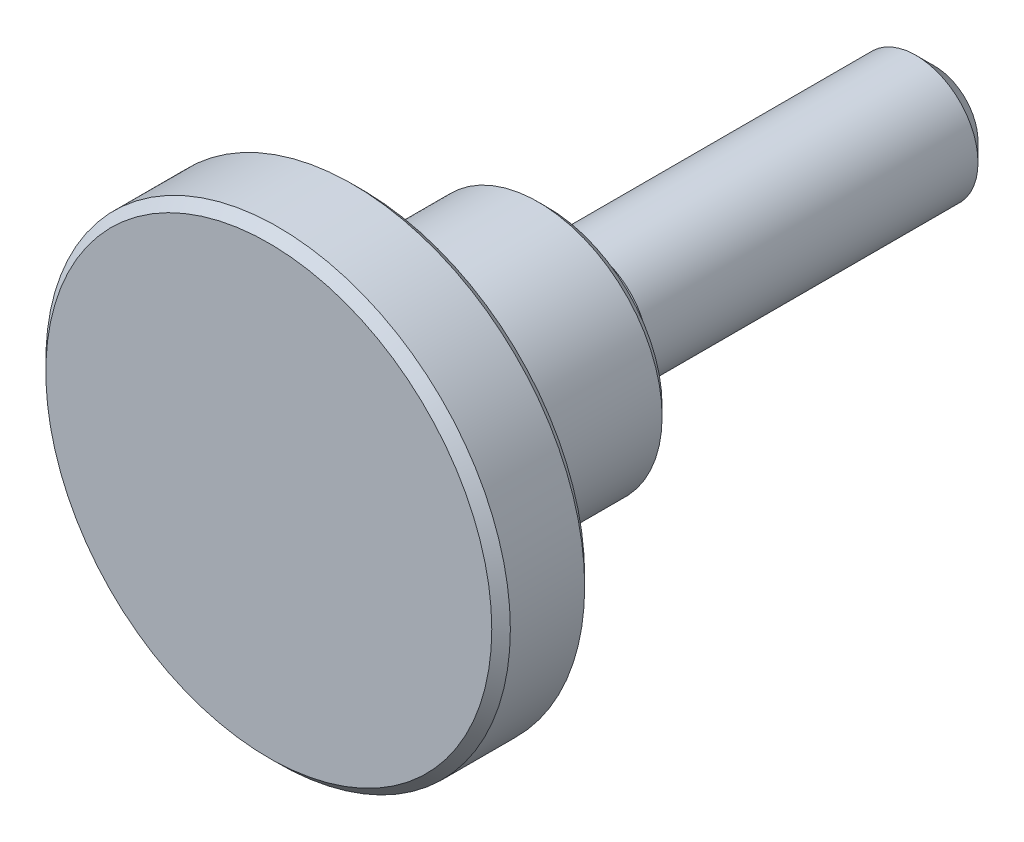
ISO-10303-21;
HEADER;
FILE_DESCRIPTION(('STEP AP214'),'2;1');
FILE_NAME('part.step','',(''),(''),'','','');
FILE_SCHEMA(('AUTOMOTIVE_DESIGN { 1 0 10303 214 1 1 1 1 }'));
ENDSEC;
DATA;
#1=APPLICATION_CONTEXT('core data for automotive mechanical design processes');
#2=APPLICATION_PROTOCOL_DEFINITION('international standard','automotive_design',2000,#1);
#3=PRODUCT_CONTEXT('',#1,'mechanical');
#4=PRODUCT('Part','Part','',(#3));
#5=PRODUCT_RELATED_PRODUCT_CATEGORY('part','',(#4));
#6=PRODUCT_DEFINITION_FORMATION('','',#4);
#7=PRODUCT_DEFINITION_CONTEXT('part definition',#1,'design');
#8=PRODUCT_DEFINITION('design','',#6,#7);
#9=PRODUCT_DEFINITION_SHAPE('','',#8);
#10=(LENGTH_UNIT() NAMED_UNIT(*) SI_UNIT(.MILLI.,.METRE.));
#11=(NAMED_UNIT(*) PLANE_ANGLE_UNIT() SI_UNIT($,.RADIAN.));
#12=(NAMED_UNIT(*) SI_UNIT($,.STERADIAN.) SOLID_ANGLE_UNIT());
#13=UNCERTAINTY_MEASURE_WITH_UNIT(LENGTH_MEASURE(1.E-05),#10,'distance_accuracy_value','');
#14=(GEOMETRIC_REPRESENTATION_CONTEXT(3) GLOBAL_UNCERTAINTY_ASSIGNED_CONTEXT((#13)) GLOBAL_UNIT_ASSIGNED_CONTEXT((#10,
#11,#12)) REPRESENTATION_CONTEXT('',''));
#15=CARTESIAN_POINT('',(0.,0.,0.));
#16=DIRECTION('',(0.,0.,1.));
#17=DIRECTION('',(1.,0.,0.));
#18=AXIS2_PLACEMENT_3D('',#15,#16,#17);
#19=CARTESIAN_POINT('',(0.,2.8,-25.));
#20=DIRECTION('',(0.,0.,1.));
#21=DIRECTION('',(1.,0.,0.));
#22=AXIS2_PLACEMENT_3D('',#19,#20,#21);
#23=PLANE('',#22);
#24=CARTESIAN_POINT('',(0.,0.,-25.));
#25=DIRECTION('',(0.,0.,1.));
#26=DIRECTION('',(1.,0.,0.));
#27=AXIS2_PLACEMENT_3D('',#24,#25,#26);
#28=CIRCLE('',#27,2.8);
#29=CARTESIAN_POINT('',(2.8,0.,-25.));
#30=VERTEX_POINT('',#29);
#31=EDGE_CURVE('E8',#30,#30,#28,.T.);
#32=ORIENTED_EDGE('',*,*,#31,.F.);
#33=EDGE_LOOP('',(#32));
#34=FACE_BOUND('',#33,.T.);
#35=ADVANCED_FACE('F12',(#34),#23,.F.);
#36=CARTESIAN_POINT('',(0.,0.,-25.));
#37=DIRECTION('',(0.,0.,1.));
#38=DIRECTION('',(1.,0.,0.));
#39=AXIS2_PLACEMENT_3D('',#36,#37,#38);
#40=CONICAL_SURFACE('',#39,2.8,0.78539816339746);
#41=CARTESIAN_POINT('',(0.,0.,-23.8));
#42=DIRECTION('',(0.,0.,1.));
#43=DIRECTION('',(1.,0.,0.));
#44=AXIS2_PLACEMENT_3D('',#41,#42,#43);
#45=CIRCLE('',#44,4.);
#46=CARTESIAN_POINT('',(4.,0.,-23.8));
#47=VERTEX_POINT('',#46);
#48=EDGE_CURVE('E18',#47,#47,#45,.T.);
#49=ORIENTED_EDGE('',*,*,#48,.F.);
#50=EDGE_LOOP('',(#49));
#51=FACE_BOUND('',#50,.T.);
#52=ORIENTED_EDGE('',*,*,#31,.T.);
#53=EDGE_LOOP('',(#52));
#54=FACE_BOUND('',#53,.T.);
#55=ADVANCED_FACE('F141',(#51,#54),#40,.T.);
#56=CARTESIAN_POINT('',(0.,0.,23.));
#57=DIRECTION('',(0.,0.,1.));
#58=DIRECTION('',(1.,0.,0.));
#59=AXIS2_PLACEMENT_3D('',#56,#57,#58);
#60=CYLINDRICAL_SURFACE('',#59,4.);
#61=CARTESIAN_POINT('',(0.,0.,-2.5));
#62=DIRECTION('',(0.,0.,1.));
#63=DIRECTION('',(1.,0.,0.));
#64=AXIS2_PLACEMENT_3D('',#61,#62,#63);
#65=CIRCLE('',#64,4.);
#66=CARTESIAN_POINT('',(4.,0.,-2.5));
#67=VERTEX_POINT('',#66);
#68=EDGE_CURVE('E22',#67,#67,#65,.T.);
#69=ORIENTED_EDGE('',*,*,#68,.F.);
#70=EDGE_LOOP('',(#69));
#71=FACE_BOUND('',#70,.T.);
#72=ORIENTED_EDGE('',*,*,#48,.T.);
#73=EDGE_LOOP('',(#72));
#74=FACE_BOUND('',#73,.T.);
#75=ADVANCED_FACE('F136',(#71,#74),#60,.T.);
#76=CARTESIAN_POINT('',(0.,4.,-2.5));
#77=DIRECTION('',(0.,0.,-1.));
#78=DIRECTION('',(-1.,0.,0.));
#79=AXIS2_PLACEMENT_3D('',#76,#77,#78);
#80=PLANE('',#79);
#81=CARTESIAN_POINT('',(0.,0.,-2.5));
#82=DIRECTION('',(0.,0.,1.));
#83=DIRECTION('',(1.,0.,0.));
#84=AXIS2_PLACEMENT_3D('',#81,#82,#83);
#85=CIRCLE('',#84,3.6);
#86=CARTESIAN_POINT('',(3.6,0.,-2.5));
#87=VERTEX_POINT('',#86);
#88=EDGE_CURVE('E26',#87,#87,#85,.T.);
#89=ORIENTED_EDGE('',*,*,#88,.F.);
#90=EDGE_LOOP('',(#89));
#91=FACE_BOUND('',#90,.T.);
#92=ORIENTED_EDGE('',*,*,#68,.T.);
#93=EDGE_LOOP('',(#92));
#94=FACE_BOUND('',#93,.T.);
#95=ADVANCED_FACE('F130',(#91,#94),#80,.F.);
#96=CARTESIAN_POINT('',(0.,0.,-1.9));
#97=DIRECTION('',(0.,0.,1.));
#98=DIRECTION('',(1.,0.,0.));
#99=AXIS2_PLACEMENT_3D('',#96,#97,#98);
#100=TOROIDAL_SURFACE('',#99,3.6,0.6);
#101=CARTESIAN_POINT('',(0.,0.,-1.9));
#102=DIRECTION('',(0.,0.,1.));
#103=DIRECTION('',(1.,0.,0.));
#104=AXIS2_PLACEMENT_3D('',#101,#102,#103);
#105=CIRCLE('',#104,3.);
#106=CARTESIAN_POINT('',(3.,0.,-1.9));
#107=VERTEX_POINT('',#106);
#108=EDGE_CURVE('E31',#107,#107,#105,.T.);
#109=ORIENTED_EDGE('',*,*,#108,.F.);
#110=EDGE_LOOP('',(#109));
#111=FACE_BOUND('',#110,.T.);
#112=ORIENTED_EDGE('',*,*,#88,.T.);
#113=EDGE_LOOP('',(#112));
#114=FACE_BOUND('',#113,.T.);
#115=ADVANCED_FACE('F124',(#111,#114),#100,.F.);
#116=CARTESIAN_POINT('',(0.,0.,23.));
#117=DIRECTION('',(0.,0.,1.));
#118=DIRECTION('',(1.,0.,0.));
#119=AXIS2_PLACEMENT_3D('',#116,#117,#118);
#120=CYLINDRICAL_SURFACE('',#119,3.);
#121=CARTESIAN_POINT('',(0.,0.,-0.599999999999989));
#122=DIRECTION('',(0.,0.,1.));
#123=DIRECTION('',(1.,0.,0.));
#124=AXIS2_PLACEMENT_3D('',#121,#122,#123);
#125=CIRCLE('',#124,3.);
#126=CARTESIAN_POINT('',(3.,0.,-0.599999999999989));
#127=VERTEX_POINT('',#126);
#128=EDGE_CURVE('E34',#127,#127,#125,.T.);
#129=ORIENTED_EDGE('',*,*,#128,.F.);
#130=EDGE_LOOP('',(#129));
#131=FACE_BOUND('',#130,.T.);
#132=ORIENTED_EDGE('',*,*,#108,.T.);
#133=EDGE_LOOP('',(#132));
#134=FACE_BOUND('',#133,.T.);
#135=ADVANCED_FACE('F118',(#131,#134),#120,.T.);
#136=CARTESIAN_POINT('',(0.,0.,-0.599999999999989));
#137=DIRECTION('',(0.,0.,1.));
#138=DIRECTION('',(1.,0.,0.));
#139=AXIS2_PLACEMENT_3D('',#136,#137,#138);
#140=TOROIDAL_SURFACE('',#139,3.6,0.6);
#141=CARTESIAN_POINT('',(0.,0.,0.));
#142=DIRECTION('',(0.,0.,1.));
#143=DIRECTION('',(1.,0.,0.));
#144=AXIS2_PLACEMENT_3D('',#141,#142,#143);
#145=CIRCLE('',#144,3.6);
#146=CARTESIAN_POINT('',(3.6,0.,0.));
#147=VERTEX_POINT('',#146);
#148=EDGE_CURVE('E37',#147,#147,#145,.T.);
#149=ORIENTED_EDGE('',*,*,#148,.F.);
#150=EDGE_LOOP('',(#149));
#151=FACE_BOUND('',#150,.T.);
#152=ORIENTED_EDGE('',*,*,#128,.T.);
#153=EDGE_LOOP('',(#152));
#154=FACE_BOUND('',#153,.T.);
#155=ADVANCED_FACE('F112',(#151,#154),#140,.F.);
#156=CARTESIAN_POINT('',(0.,7.4,0.));
#157=DIRECTION('',(0.,0.,1.));
#158=DIRECTION('',(1.,0.,0.));
#159=AXIS2_PLACEMENT_3D('',#156,#157,#158);
#160=PLANE('',#159);
#161=CARTESIAN_POINT('',(0.,0.,0.));
#162=DIRECTION('',(0.,0.,1.));
#163=DIRECTION('',(1.,0.,0.));
#164=AXIS2_PLACEMENT_3D('',#161,#162,#163);
#165=CIRCLE('',#164,7.4);
#166=CARTESIAN_POINT('',(7.4,0.,0.));
#167=VERTEX_POINT('',#166);
#168=EDGE_CURVE('E40',#167,#167,#165,.T.);
#169=ORIENTED_EDGE('',*,*,#168,.F.);
#170=EDGE_LOOP('',(#169));
#171=FACE_BOUND('',#170,.T.);
#172=ORIENTED_EDGE('',*,*,#148,.T.);
#173=EDGE_LOOP('',(#172));
#174=FACE_BOUND('',#173,.T.);
#175=ADVANCED_FACE('F106',(#171,#174),#160,.F.);
#176=CARTESIAN_POINT('',(0.,0.,0.));
#177=DIRECTION('',(0.,0.,1.));
#178=DIRECTION('',(1.,0.,0.));
#179=AXIS2_PLACEMENT_3D('',#176,#177,#178);
#180=CONICAL_SURFACE('',#179,7.4,0.78539816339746);
#181=CARTESIAN_POINT('',(0.,0.,0.599999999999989));
#182=DIRECTION('',(0.,0.,1.));
#183=DIRECTION('',(1.,0.,0.));
#184=AXIS2_PLACEMENT_3D('',#181,#182,#183);
#185=CIRCLE('',#184,8.);
#186=CARTESIAN_POINT('',(8.,0.,0.599999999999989));
#187=VERTEX_POINT('',#186);
#188=EDGE_CURVE('E43',#187,#187,#185,.T.);
#189=ORIENTED_EDGE('',*,*,#188,.F.);
#190=EDGE_LOOP('',(#189));
#191=FACE_BOUND('',#190,.T.);
#192=ORIENTED_EDGE('',*,*,#168,.T.);
#193=EDGE_LOOP('',(#192));
#194=FACE_BOUND('',#193,.T.);
#195=ADVANCED_FACE('F100',(#191,#194),#180,.T.);
#196=CARTESIAN_POINT('',(0.,0.,23.));
#197=DIRECTION('',(0.,0.,1.));
#198=DIRECTION('',(1.,0.,0.));
#199=AXIS2_PLACEMENT_3D('',#196,#197,#198);
#200=CYLINDRICAL_SURFACE('',#199,8.);
#201=CARTESIAN_POINT('',(0.,0.,10.));
#202=DIRECTION('',(0.,0.,1.));
#203=DIRECTION('',(1.,0.,0.));
#204=AXIS2_PLACEMENT_3D('',#201,#202,#203);
#205=CIRCLE('',#204,8.);
#206=CARTESIAN_POINT('',(8.,0.,10.));
#207=VERTEX_POINT('',#206);
#208=EDGE_CURVE('E46',#207,#207,#205,.T.);
#209=ORIENTED_EDGE('',*,*,#208,.F.);
#210=EDGE_LOOP('',(#209));
#211=FACE_BOUND('',#210,.T.);
#212=ORIENTED_EDGE('',*,*,#188,.T.);
#213=EDGE_LOOP('',(#212));
#214=FACE_BOUND('',#213,.T.);
#215=ADVANCED_FACE('F94',(#211,#214),#200,.T.);
#216=CARTESIAN_POINT('',(0.,0.,10.));
#217=DIRECTION('',(0.,0.,1.));
#218=DIRECTION('',(1.,0.,0.));
#219=AXIS2_PLACEMENT_3D('',#216,#217,#218);
#220=TOROIDAL_SURFACE('',#219,10.,2.);
#221=CARTESIAN_POINT('',(0.,0.,12.));
#222=DIRECTION('',(0.,0.,1.));
#223=DIRECTION('',(1.,0.,0.));
#224=AXIS2_PLACEMENT_3D('',#221,#222,#223);
#225=CIRCLE('',#224,10.);
#226=CARTESIAN_POINT('',(10.,0.,12.));
#227=VERTEX_POINT('',#226);
#228=EDGE_CURVE('E49',#227,#227,#225,.T.);
#229=ORIENTED_EDGE('',*,*,#228,.F.);
#230=EDGE_LOOP('',(#229));
#231=FACE_BOUND('',#230,.T.);
#232=ORIENTED_EDGE('',*,*,#208,.T.);
#233=EDGE_LOOP('',(#232));
#234=FACE_BOUND('',#233,.T.);
#235=ADVANCED_FACE('F88',(#231,#234),#220,.F.);
#236=CARTESIAN_POINT('',(0.,14.4,12.));
#237=DIRECTION('',(0.,0.,1.));
#238=DIRECTION('',(1.,0.,0.));
#239=AXIS2_PLACEMENT_3D('',#236,#237,#238);
#240=PLANE('',#239);
#241=CARTESIAN_POINT('',(0.,0.,12.));
#242=DIRECTION('',(0.,0.,1.));
#243=DIRECTION('',(1.,0.,0.));
#244=AXIS2_PLACEMENT_3D('',#241,#242,#243);
#245=CIRCLE('',#244,14.4);
#246=CARTESIAN_POINT('',(14.4,0.,12.));
#247=VERTEX_POINT('',#246);
#248=EDGE_CURVE('E52',#247,#247,#245,.T.);
#249=ORIENTED_EDGE('',*,*,#248,.F.);
#250=EDGE_LOOP('',(#249));
#251=FACE_BOUND('',#250,.T.);
#252=ORIENTED_EDGE('',*,*,#228,.T.);
#253=EDGE_LOOP('',(#252));
#254=FACE_BOUND('',#253,.T.);
#255=ADVANCED_FACE('F82',(#251,#254),#240,.F.);
#256=CARTESIAN_POINT('',(0.,0.,12.));
#257=DIRECTION('',(0.,0.,1.));
#258=DIRECTION('',(1.,0.,0.));
#259=AXIS2_PLACEMENT_3D('',#256,#257,#258);
#260=CONICAL_SURFACE('',#259,14.4,0.785398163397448);
#261=CARTESIAN_POINT('',(0.,0.,12.6));
#262=DIRECTION('',(0.,0.,1.));
#263=DIRECTION('',(1.,0.,0.));
#264=AXIS2_PLACEMENT_3D('',#261,#262,#263);
#265=CIRCLE('',#264,15.);
#266=CARTESIAN_POINT('',(15.,0.,12.6));
#267=VERTEX_POINT('',#266);
#268=EDGE_CURVE('E55',#267,#267,#265,.T.);
#269=ORIENTED_EDGE('',*,*,#268,.F.);
#270=EDGE_LOOP('',(#269));
#271=FACE_BOUND('',#270,.T.);
#272=ORIENTED_EDGE('',*,*,#248,.T.);
#273=EDGE_LOOP('',(#272));
#274=FACE_BOUND('',#273,.T.);
#275=ADVANCED_FACE('F76',(#271,#274),#260,.T.);
#276=CARTESIAN_POINT('',(0.,0.,23.));
#277=DIRECTION('',(0.,0.,1.));
#278=DIRECTION('',(1.,0.,0.));
#279=AXIS2_PLACEMENT_3D('',#276,#277,#278);
#280=CYLINDRICAL_SURFACE('',#279,15.);
#281=CARTESIAN_POINT('',(0.,0.,17.4));
#282=DIRECTION('',(0.,0.,1.));
#283=DIRECTION('',(1.,0.,0.));
#284=AXIS2_PLACEMENT_3D('',#281,#282,#283);
#285=CIRCLE('',#284,15.);
#286=CARTESIAN_POINT('',(15.,0.,17.4));
#287=VERTEX_POINT('',#286);
#288=EDGE_CURVE('E58',#287,#287,#285,.T.);
#289=ORIENTED_EDGE('',*,*,#288,.F.);
#290=EDGE_LOOP('',(#289));
#291=FACE_BOUND('',#290,.T.);
#292=ORIENTED_EDGE('',*,*,#268,.T.);
#293=EDGE_LOOP('',(#292));
#294=FACE_BOUND('',#293,.T.);
#295=ADVANCED_FACE('F70',(#291,#294),#280,.T.);
#296=CARTESIAN_POINT('',(0.,0.,17.4));
#297=DIRECTION('',(0.,0.,-1.));
#298=DIRECTION('',(-1.,0.,0.));
#299=AXIS2_PLACEMENT_3D('',#296,#297,#298);
#300=CONICAL_SURFACE('',#299,15.,0.785398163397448);
#301=CARTESIAN_POINT('',(0.,0.,18.));
#302=DIRECTION('',(0.,0.,1.));
#303=DIRECTION('',(1.,0.,0.));
#304=AXIS2_PLACEMENT_3D('',#301,#302,#303);
#305=CIRCLE('',#304,14.4);
#306=CARTESIAN_POINT('',(14.4,0.,18.));
#307=VERTEX_POINT('',#306);
#308=EDGE_CURVE('E61',#307,#307,#305,.T.);
#309=ORIENTED_EDGE('',*,*,#308,.F.);
#310=EDGE_LOOP('',(#309));
#311=FACE_BOUND('',#310,.T.);
#312=ORIENTED_EDGE('',*,*,#288,.T.);
#313=EDGE_LOOP('',(#312));
#314=FACE_BOUND('',#313,.T.);
#315=ADVANCED_FACE('F67',(#311,#314),#300,.T.);
#316=CARTESIAN_POINT('',(0.,14.4,18.));
#317=DIRECTION('',(0.,0.,-1.));
#318=DIRECTION('',(-1.,0.,0.));
#319=AXIS2_PLACEMENT_3D('',#316,#317,#318);
#320=PLANE('',#319);
#321=ORIENTED_EDGE('',*,*,#308,.T.);
#322=EDGE_LOOP('',(#321));
#323=FACE_BOUND('',#322,.T.);
#324=ADVANCED_FACE('F65',(#323),#320,.F.);
#325=CLOSED_SHELL('',(#35,#55,#75,#95,#115,#135,#155,#175,#195,#215,#235,#255,#275,#295,#315,#324));
#326=MANIFOLD_SOLID_BREP('B1',#325);
#327=ADVANCED_BREP_SHAPE_REPRESENTATION('',(#18,#326),#14);
#328=SHAPE_DEFINITION_REPRESENTATION(#9,#327);
ENDSEC;
END-ISO-10303-21;
